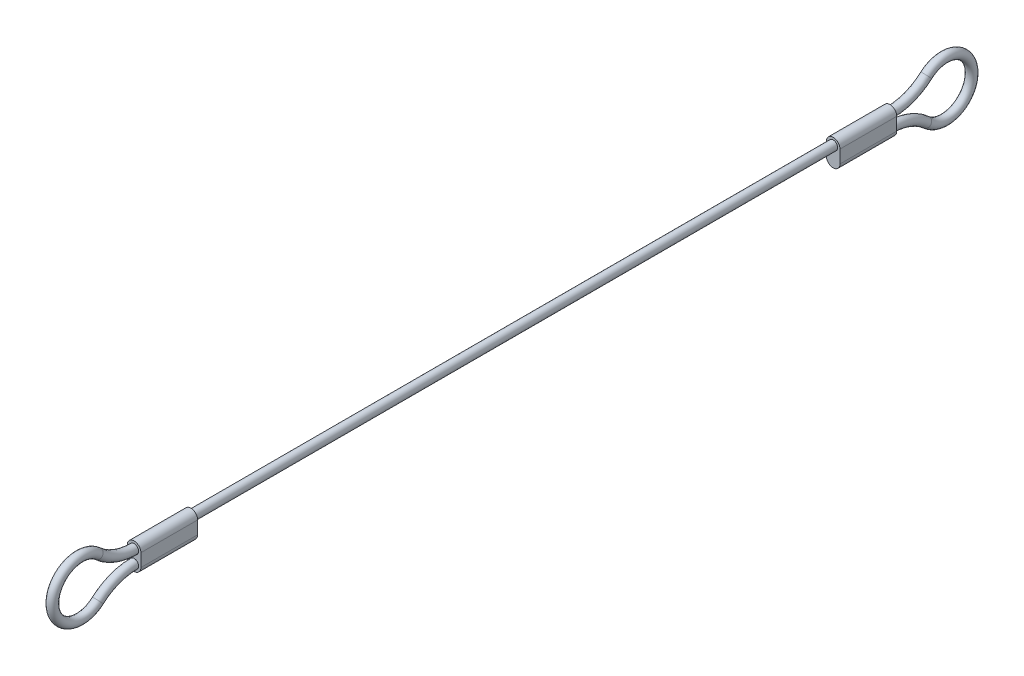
ISO-10303-21;
HEADER;
FILE_DESCRIPTION(('STEP AP214'),'2;1');
FILE_NAME('part.step','',(''),(''),'','','');
FILE_SCHEMA(('AUTOMOTIVE_DESIGN { 1 0 10303 214 1 1 1 1 }'));
ENDSEC;
DATA;
#1=APPLICATION_CONTEXT('core data for automotive mechanical design processes');
#2=APPLICATION_PROTOCOL_DEFINITION('international standard','automotive_design',2000,#1);
#3=PRODUCT_CONTEXT('',#1,'mechanical');
#4=PRODUCT('Part','Part','',(#3));
#5=PRODUCT_RELATED_PRODUCT_CATEGORY('part','',(#4));
#6=PRODUCT_DEFINITION_FORMATION('','',#4);
#7=PRODUCT_DEFINITION_CONTEXT('part definition',#1,'design');
#8=PRODUCT_DEFINITION('design','',#6,#7);
#9=PRODUCT_DEFINITION_SHAPE('','',#8);
#10=(LENGTH_UNIT() NAMED_UNIT(*) SI_UNIT(.MILLI.,.METRE.));
#11=(NAMED_UNIT(*) PLANE_ANGLE_UNIT() SI_UNIT($,.RADIAN.));
#12=(NAMED_UNIT(*) SI_UNIT($,.STERADIAN.) SOLID_ANGLE_UNIT());
#13=UNCERTAINTY_MEASURE_WITH_UNIT(LENGTH_MEASURE(1.E-05),#10,'distance_accuracy_value','');
#14=(GEOMETRIC_REPRESENTATION_CONTEXT(3) GLOBAL_UNCERTAINTY_ASSIGNED_CONTEXT((#13)) GLOBAL_UNIT_ASSIGNED_CONTEXT((#10,
#11,#12)) REPRESENTATION_CONTEXT('',''));
#15=CARTESIAN_POINT('',(0.,0.,0.));
#16=DIRECTION('',(0.,0.,1.));
#17=DIRECTION('',(1.,0.,0.));
#18=AXIS2_PLACEMENT_3D('',#15,#16,#17);
#19=CARTESIAN_POINT('',(0.,0.,-66.6));
#20=DIRECTION('',(0.,0.,1.));
#21=DIRECTION('',(1.,0.,0.));
#22=AXIS2_PLACEMENT_3D('',#19,#20,#21);
#23=CYLINDRICAL_SURFACE('',#22,0.795);
#24=CARTESIAN_POINT('',(0.,0.,-56.6));
#25=DIRECTION('',(0.,0.,1.));
#26=DIRECTION('',(0.,-1.,0.));
#27=AXIS2_PLACEMENT_3D('',#24,#25,#26);
#28=CIRCLE('',#27,0.795);
#29=CARTESIAN_POINT('',(0.,-0.795,-56.6));
#30=VERTEX_POINT('',#29);
#31=EDGE_CURVE('E11',#30,#30,#28,.F.);
#32=ORIENTED_EDGE('',*,*,#31,.F.);
#33=EDGE_LOOP('',(#32));
#34=FACE_BOUND('',#33,.T.);
#35=CARTESIAN_POINT('',(0.,0.,56.6));
#36=DIRECTION('',(0.,0.,-1.));
#37=DIRECTION('',(0.,1.,0.));
#38=AXIS2_PLACEMENT_3D('',#35,#36,#37);
#39=CIRCLE('',#38,0.795);
#40=CARTESIAN_POINT('',(0.,0.795,56.6));
#41=VERTEX_POINT('',#40);
#42=EDGE_CURVE('E48',#41,#41,#39,.F.);
#43=ORIENTED_EDGE('',*,*,#42,.F.);
#44=EDGE_LOOP('',(#43));
#45=FACE_BOUND('',#44,.T.);
#46=ADVANCED_FACE('F38',(#34,#45),#23,.T.);
#47=CARTESIAN_POINT('',(0.,0.,66.6));
#48=DIRECTION('',(0.,0.,-1.));
#49=DIRECTION('',(0.,1.,0.));
#50=AXIS2_PLACEMENT_3D('',#47,#48,#49);
#51=PLANE('',#50);
#52=CARTESIAN_POINT('',(0.,0.,66.6));
#53=DIRECTION('',(0.,0.,-1.));
#54=DIRECTION('',(0.,1.,0.));
#55=AXIS2_PLACEMENT_3D('',#52,#53,#54);
#56=CIRCLE('',#55,1.2);
#57=CARTESIAN_POINT('',(-1.2,0.,66.6));
#58=VERTEX_POINT('',#57);
#59=CARTESIAN_POINT('',(1.2,0.,66.6));
#60=VERTEX_POINT('',#59);
#61=EDGE_CURVE('E183',#58,#60,#56,.T.);
#62=ORIENTED_EDGE('',*,*,#61,.F.);
#63=DIRECTION('',(0.,1.,0.));
#64=VECTOR('',#63,1.);
#65=CARTESIAN_POINT('',(-1.2,0.,66.6));
#66=LINE('',#65,#64);
#67=CARTESIAN_POINT('',(-1.2,-2.26625258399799,66.6));
#68=VERTEX_POINT('',#67);
#69=EDGE_CURVE('E80',#68,#58,#66,.T.);
#70=ORIENTED_EDGE('',*,*,#69,.F.);
#71=CARTESIAN_POINT('',(0.,-2.26625258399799,66.6));
#72=DIRECTION('',(0.,0.,-1.));
#73=DIRECTION('',(0.,1.,0.));
#74=AXIS2_PLACEMENT_3D('',#71,#72,#73);
#75=CIRCLE('',#74,1.2);
#76=CARTESIAN_POINT('',(1.2,-2.26625258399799,66.6));
#77=VERTEX_POINT('',#76);
#78=EDGE_CURVE('E74',#77,#68,#75,.T.);
#79=ORIENTED_EDGE('',*,*,#78,.F.);
#80=DIRECTION('',(0.,-1.,0.));
#81=VECTOR('',#80,1.);
#82=CARTESIAN_POINT('',(1.2,0.,66.6));
#83=LINE('',#82,#81);
#84=EDGE_CURVE('E187',#60,#77,#83,.T.);
#85=ORIENTED_EDGE('',*,*,#84,.F.);
#86=EDGE_LOOP('',(#62,#70,#79,#85));
#87=FACE_BOUND('',#86,.T.);
#88=CARTESIAN_POINT('',(0.,0.,66.6));
#89=DIRECTION('',(0.,0.,-1.));
#90=DIRECTION('',(0.,1.,0.));
#91=AXIS2_PLACEMENT_3D('',#88,#89,#90);
#92=CIRCLE('',#91,0.795);
#93=CARTESIAN_POINT('',(0.,-0.795000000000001,66.6));
#94=VERTEX_POINT('',#93);
#95=EDGE_CURVE('E205',#94,#94,#92,.F.);
#96=ORIENTED_EDGE('',*,*,#95,.F.);
#97=EDGE_LOOP('',(#96));
#98=FACE_BOUND('',#97,.T.);
#99=CARTESIAN_POINT('',(0.,-2.26625258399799,66.6));
#100=DIRECTION('',(0.,0.,-1.));
#101=DIRECTION('',(1.,0.,0.));
#102=AXIS2_PLACEMENT_3D('',#99,#100,#101);
#103=CIRCLE('',#102,0.795);
#104=CARTESIAN_POINT('',(0.,-1.47125258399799,66.6));
#105=VERTEX_POINT('',#104);
#106=EDGE_CURVE('E230',#105,#105,#103,.T.);
#107=ORIENTED_EDGE('',*,*,#106,.T.);
#108=EDGE_LOOP('',(#107));
#109=FACE_BOUND('',#108,.T.);
#110=ADVANCED_FACE('F240',(#87,#98,#109),#51,.F.);
#111=CARTESIAN_POINT('',(0.,0.,56.6));
#112=DIRECTION('',(0.,0.,1.));
#113=DIRECTION('',(0.,-1.,0.));
#114=AXIS2_PLACEMENT_3D('',#111,#112,#113);
#115=CYLINDRICAL_SURFACE('',#114,1.2);
#116=ORIENTED_EDGE('',*,*,#61,.T.);
#117=DIRECTION('',(0.,0.,1.));
#118=VECTOR('',#117,1.);
#119=CARTESIAN_POINT('',(1.2,0.,56.6));
#120=LINE('',#119,#118);
#121=CARTESIAN_POINT('',(1.2,0.,56.6));
#122=VERTEX_POINT('',#121);
#123=EDGE_CURVE('E202',#122,#60,#120,.T.);
#124=ORIENTED_EDGE('',*,*,#123,.F.);
#125=CARTESIAN_POINT('',(0.,0.,56.6));
#126=DIRECTION('',(0.,0.,-1.));
#127=DIRECTION('',(0.,1.,0.));
#128=AXIS2_PLACEMENT_3D('',#125,#126,#127);
#129=CIRCLE('',#128,1.2);
#130=CARTESIAN_POINT('',(-1.2,0.,56.6));
#131=VERTEX_POINT('',#130);
#132=EDGE_CURVE('E172',#131,#122,#129,.T.);
#133=ORIENTED_EDGE('',*,*,#132,.F.);
#134=DIRECTION('',(0.,0.,1.));
#135=VECTOR('',#134,1.);
#136=CARTESIAN_POINT('',(-1.2,0.,56.6));
#137=LINE('',#136,#135);
#138=EDGE_CURVE('E182',#131,#58,#137,.T.);
#139=ORIENTED_EDGE('',*,*,#138,.T.);
#140=EDGE_LOOP('',(#116,#124,#133,#139));
#141=FACE_BOUND('',#140,.T.);
#142=ADVANCED_FACE('F246',(#141),#115,.T.);
#143=CARTESIAN_POINT('',(1.2,0.,56.6));
#144=DIRECTION('',(-1.,0.,0.));
#145=DIRECTION('',(0.,-1.,0.));
#146=AXIS2_PLACEMENT_3D('',#143,#144,#145);
#147=PLANE('',#146);
#148=ORIENTED_EDGE('',*,*,#84,.T.);
#149=DIRECTION('',(0.,0.,1.));
#150=VECTOR('',#149,1.);
#151=CARTESIAN_POINT('',(1.2,-2.266252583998,56.6));
#152=LINE('',#151,#150);
#153=CARTESIAN_POINT('',(1.2,-2.266252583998,56.6));
#154=VERTEX_POINT('',#153);
#155=EDGE_CURVE('E199',#154,#77,#152,.T.);
#156=ORIENTED_EDGE('',*,*,#155,.F.);
#157=DIRECTION('',(0.,-1.,0.));
#158=VECTOR('',#157,1.);
#159=CARTESIAN_POINT('',(1.2,0.,56.6));
#160=LINE('',#159,#158);
#161=EDGE_CURVE('E88',#122,#154,#160,.T.);
#162=ORIENTED_EDGE('',*,*,#161,.F.);
#163=ORIENTED_EDGE('',*,*,#123,.T.);
#164=EDGE_LOOP('',(#148,#156,#162,#163));
#165=FACE_BOUND('',#164,.T.);
#166=ADVANCED_FACE('F288',(#165),#147,.F.);
#167=CARTESIAN_POINT('',(0.,-2.266252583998,56.6));
#168=DIRECTION('',(0.,0.,1.));
#169=DIRECTION('',(0.,-1.,0.));
#170=AXIS2_PLACEMENT_3D('',#167,#168,#169);
#171=CYLINDRICAL_SURFACE('',#170,1.2);
#172=ORIENTED_EDGE('',*,*,#78,.T.);
#173=DIRECTION('',(0.,0.,1.));
#174=VECTOR('',#173,1.);
#175=CARTESIAN_POINT('',(-1.2,-2.266252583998,56.6));
#176=LINE('',#175,#174);
#177=CARTESIAN_POINT('',(-1.2,-2.266252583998,56.6));
#178=VERTEX_POINT('',#177);
#179=EDGE_CURVE('E196',#178,#68,#176,.T.);
#180=ORIENTED_EDGE('',*,*,#179,.F.);
#181=CARTESIAN_POINT('',(0.,-2.266252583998,56.6));
#182=DIRECTION('',(0.,0.,-1.));
#183=DIRECTION('',(0.,1.,0.));
#184=AXIS2_PLACEMENT_3D('',#181,#182,#183);
#185=CIRCLE('',#184,1.2);
#186=EDGE_CURVE('E177',#154,#178,#185,.T.);
#187=ORIENTED_EDGE('',*,*,#186,.F.);
#188=ORIENTED_EDGE('',*,*,#155,.T.);
#189=EDGE_LOOP('',(#172,#180,#187,#188));
#190=FACE_BOUND('',#189,.T.);
#191=ADVANCED_FACE('F281',(#190),#171,.T.);
#192=CARTESIAN_POINT('',(-1.2,0.,56.6));
#193=DIRECTION('',(1.,0.,0.));
#194=DIRECTION('',(0.,1.,0.));
#195=AXIS2_PLACEMENT_3D('',#192,#193,#194);
#196=PLANE('',#195);
#197=ORIENTED_EDGE('',*,*,#69,.T.);
#198=ORIENTED_EDGE('',*,*,#138,.F.);
#199=DIRECTION('',(0.,1.,0.));
#200=VECTOR('',#199,1.);
#201=CARTESIAN_POINT('',(-1.2,0.,56.6));
#202=LINE('',#201,#200);
#203=EDGE_CURVE('E56',#178,#131,#202,.T.);
#204=ORIENTED_EDGE('',*,*,#203,.F.);
#205=ORIENTED_EDGE('',*,*,#179,.T.);
#206=EDGE_LOOP('',(#197,#198,#204,#205));
#207=FACE_BOUND('',#206,.T.);
#208=ADVANCED_FACE('F276',(#207),#196,.F.);
#209=CARTESIAN_POINT('',(0.,0.,56.6));
#210=DIRECTION('',(0.,0.,-1.));
#211=DIRECTION('',(0.,1.,0.));
#212=AXIS2_PLACEMENT_3D('',#209,#210,#211);
#213=PLANE('',#212);
#214=ORIENTED_EDGE('',*,*,#42,.T.);
#215=EDGE_LOOP('',(#214));
#216=FACE_BOUND('',#215,.T.);
#217=ORIENTED_EDGE('',*,*,#132,.T.);
#218=ORIENTED_EDGE('',*,*,#161,.T.);
#219=ORIENTED_EDGE('',*,*,#186,.T.);
#220=ORIENTED_EDGE('',*,*,#203,.T.);
#221=EDGE_LOOP('',(#217,#218,#219,#220));
#222=FACE_BOUND('',#221,.T.);
#223=ADVANCED_FACE('F237',(#216,#222),#213,.T.);
#224=CARTESIAN_POINT('',(0.,-11.866252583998,66.6));
#225=DIRECTION('',(-1.,0.,0.));
#226=DIRECTION('',(0.,0.,1.));
#227=AXIS2_PLACEMENT_3D('',#224,#225,#226);
#228=TOROIDAL_SURFACE('',#227,9.59999999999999,0.795);
#229=CARTESIAN_POINT('',(0.,-4.71083505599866,73.));
#230=DIRECTION('',(0.,0.666666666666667,-0.74535599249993));
#231=DIRECTION('',(1.,0.,0.));
#232=AXIS2_PLACEMENT_3D('',#229,#230,#231);
#233=CIRCLE('',#232,0.795);
#234=CARTESIAN_POINT('',(0.,-4.11827704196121,73.53));
#235=VERTEX_POINT('',#234);
#236=EDGE_CURVE('E227',#235,#235,#233,.T.);
#237=CARTESIAN_POINT('',(0.,-11.866252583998,66.6));
#238=DIRECTION('',(-1.,0.,0.));
#239=DIRECTION('',(0.,0.,1.));
#240=AXIS2_PLACEMENT_3D('',#237,#238,#239);
#241=CIRCLE('',#240,10.395);
#242=EDGE_CURVE('',#235,#105,#241,.T.);
#243=ORIENTED_EDGE('',*,*,#236,.T.);
#244=ORIENTED_EDGE('',*,*,#106,.F.);
#245=ORIENTED_EDGE('',*,*,#242,.T.);
#246=ORIENTED_EDGE('',*,*,#242,.F.);
#247=EDGE_LOOP('',(#243,#245,#244,#246));
#248=FACE_BOUND('',#247,.T.);
#249=ADVANCED_FACE('F40',(#248),#228,.T.);
#250=CARTESIAN_POINT('',(0.,-1.13312629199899,76.2));
#251=DIRECTION('',(1.,0.,0.));
#252=DIRECTION('',(0.,0.,-1.));
#253=AXIS2_PLACEMENT_3D('',#250,#251,#252);
#254=TOROIDAL_SURFACE('',#253,4.8,0.795);
#255=ORIENTED_EDGE('',*,*,#236,.F.);
#256=EDGE_LOOP('',(#255));
#257=FACE_BOUND('',#256,.T.);
#258=CARTESIAN_POINT('',(0.,2.44458247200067,73.));
#259=DIRECTION('',(0.,0.666666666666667,0.74535599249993));
#260=DIRECTION('',(1.,0.,0.));
#261=AXIS2_PLACEMENT_3D('',#258,#259,#260);
#262=CIRCLE('',#261,0.795);
#263=CARTESIAN_POINT('',(0.,1.85202445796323,73.53));
#264=VERTEX_POINT('',#263);
#265=EDGE_CURVE('E224',#264,#264,#262,.T.);
#266=ORIENTED_EDGE('',*,*,#265,.T.);
#267=EDGE_LOOP('',(#266));
#268=FACE_BOUND('',#267,.T.);
#269=ADVANCED_FACE('F256',(#257,#268),#254,.T.);
#270=CARTESIAN_POINT('',(0.,9.59999999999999,66.6));
#271=DIRECTION('',(-1.,0.,0.));
#272=DIRECTION('',(0.,0.,1.));
#273=AXIS2_PLACEMENT_3D('',#270,#271,#272);
#274=TOROIDAL_SURFACE('',#273,9.59999999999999,0.795);
#275=CARTESIAN_POINT('',(0.,9.59999999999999,66.6));
#276=DIRECTION('',(-1.,0.,0.));
#277=DIRECTION('',(0.,0.,1.));
#278=AXIS2_PLACEMENT_3D('',#275,#276,#277);
#279=CIRCLE('',#278,10.395);
#280=EDGE_CURVE('',#94,#264,#279,.T.);
#281=ORIENTED_EDGE('',*,*,#95,.T.);
#282=ORIENTED_EDGE('',*,*,#265,.F.);
#283=ORIENTED_EDGE('',*,*,#280,.T.);
#284=ORIENTED_EDGE('',*,*,#280,.F.);
#285=EDGE_LOOP('',(#281,#283,#282,#284));
#286=FACE_BOUND('',#285,.T.);
#287=ADVANCED_FACE('F254',(#286),#274,.T.);
#288=CARTESIAN_POINT('',(0.,0.,-56.6));
#289=DIRECTION('',(0.,0.,-1.));
#290=DIRECTION('',(0.,1.,0.));
#291=AXIS2_PLACEMENT_3D('',#288,#289,#290);
#292=CYLINDRICAL_SURFACE('',#291,1.2);
#293=CARTESIAN_POINT('',(0.,0.,-66.6));
#294=DIRECTION('',(0.,0.,-1.));
#295=DIRECTION('',(0.,1.,0.));
#296=AXIS2_PLACEMENT_3D('',#293,#294,#295);
#297=CIRCLE('',#296,1.2);
#298=CARTESIAN_POINT('',(-1.2,0.,-66.6));
#299=VERTEX_POINT('',#298);
#300=CARTESIAN_POINT('',(1.2,0.,-66.6));
#301=VERTEX_POINT('',#300);
#302=EDGE_CURVE('E121',#299,#301,#297,.T.);
#303=ORIENTED_EDGE('',*,*,#302,.F.);
#304=DIRECTION('',(0.,0.,-1.));
#305=VECTOR('',#304,1.);
#306=CARTESIAN_POINT('',(-1.2,0.,-56.6));
#307=LINE('',#306,#305);
#308=CARTESIAN_POINT('',(-1.2,0.,-56.6));
#309=VERTEX_POINT('',#308);
#310=EDGE_CURVE('E115',#309,#299,#307,.T.);
#311=ORIENTED_EDGE('',*,*,#310,.F.);
#312=CARTESIAN_POINT('',(0.,0.,-56.6));
#313=DIRECTION('',(0.,0.,-1.));
#314=DIRECTION('',(0.,1.,0.));
#315=AXIS2_PLACEMENT_3D('',#312,#313,#314);
#316=CIRCLE('',#315,1.2);
#317=CARTESIAN_POINT('',(1.2,0.,-56.6));
#318=VERTEX_POINT('',#317);
#319=EDGE_CURVE('E118',#309,#318,#316,.T.);
#320=ORIENTED_EDGE('',*,*,#319,.T.);
#321=DIRECTION('',(0.,0.,-1.));
#322=VECTOR('',#321,1.);
#323=CARTESIAN_POINT('',(1.2,0.,-56.6));
#324=LINE('',#323,#322);
#325=EDGE_CURVE('E152',#318,#301,#324,.T.);
#326=ORIENTED_EDGE('',*,*,#325,.T.);
#327=EDGE_LOOP('',(#303,#311,#320,#326));
#328=FACE_BOUND('',#327,.T.);
#329=ADVANCED_FACE('F117',(#328),#292,.T.);
#330=CARTESIAN_POINT('',(-1.2,0.,-56.6));
#331=DIRECTION('',(-1.,0.,0.));
#332=DIRECTION('',(0.,-1.,0.));
#333=AXIS2_PLACEMENT_3D('',#330,#331,#332);
#334=PLANE('',#333);
#335=DIRECTION('',(0.,1.,0.));
#336=VECTOR('',#335,1.);
#337=CARTESIAN_POINT('',(-1.2,0.,-66.6));
#338=LINE('',#337,#336);
#339=CARTESIAN_POINT('',(-1.2,-2.26625258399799,-66.6));
#340=VERTEX_POINT('',#339);
#341=EDGE_CURVE('E155',#340,#299,#338,.T.);
#342=ORIENTED_EDGE('',*,*,#341,.F.);
#343=DIRECTION('',(0.,0.,-1.));
#344=VECTOR('',#343,1.);
#345=CARTESIAN_POINT('',(-1.2,-2.266252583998,-56.6));
#346=LINE('',#345,#344);
#347=CARTESIAN_POINT('',(-1.2,-2.266252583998,-56.6));
#348=VERTEX_POINT('',#347);
#349=EDGE_CURVE('E128',#348,#340,#346,.T.);
#350=ORIENTED_EDGE('',*,*,#349,.F.);
#351=DIRECTION('',(0.,1.,0.));
#352=VECTOR('',#351,1.);
#353=CARTESIAN_POINT('',(-1.2,0.,-56.6));
#354=LINE('',#353,#352);
#355=EDGE_CURVE('E134',#348,#309,#354,.T.);
#356=ORIENTED_EDGE('',*,*,#355,.T.);
#357=ORIENTED_EDGE('',*,*,#310,.T.);
#358=EDGE_LOOP('',(#342,#350,#356,#357));
#359=FACE_BOUND('',#358,.T.);
#360=ADVANCED_FACE('F141',(#359),#334,.T.);
#361=CARTESIAN_POINT('',(0.,-2.266252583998,-56.6));
#362=DIRECTION('',(0.,0.,-1.));
#363=DIRECTION('',(0.,1.,0.));
#364=AXIS2_PLACEMENT_3D('',#361,#362,#363);
#365=CYLINDRICAL_SURFACE('',#364,1.2);
#366=CARTESIAN_POINT('',(0.,-2.26625258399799,-66.6));
#367=DIRECTION('',(0.,0.,-1.));
#368=DIRECTION('',(0.,1.,0.));
#369=AXIS2_PLACEMENT_3D('',#366,#367,#368);
#370=CIRCLE('',#369,1.2);
#371=CARTESIAN_POINT('',(1.2,-2.26625258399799,-66.6));
#372=VERTEX_POINT('',#371);
#373=EDGE_CURVE('E158',#372,#340,#370,.T.);
#374=ORIENTED_EDGE('',*,*,#373,.F.);
#375=DIRECTION('',(0.,0.,-1.));
#376=VECTOR('',#375,1.);
#377=CARTESIAN_POINT('',(1.2,-2.266252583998,-56.6));
#378=LINE('',#377,#376);
#379=CARTESIAN_POINT('',(1.2,-2.266252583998,-56.6));
#380=VERTEX_POINT('',#379);
#381=EDGE_CURVE('E167',#380,#372,#378,.T.);
#382=ORIENTED_EDGE('',*,*,#381,.F.);
#383=CARTESIAN_POINT('',(0.,-2.266252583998,-56.6));
#384=DIRECTION('',(0.,0.,-1.));
#385=DIRECTION('',(0.,1.,0.));
#386=AXIS2_PLACEMENT_3D('',#383,#384,#385);
#387=CIRCLE('',#386,1.2);
#388=EDGE_CURVE('E143',#380,#348,#387,.T.);
#389=ORIENTED_EDGE('',*,*,#388,.T.);
#390=ORIENTED_EDGE('',*,*,#349,.T.);
#391=EDGE_LOOP('',(#374,#382,#389,#390));
#392=FACE_BOUND('',#391,.T.);
#393=ADVANCED_FACE('F321',(#392),#365,.T.);
#394=CARTESIAN_POINT('',(1.2,0.,-56.6));
#395=DIRECTION('',(1.,0.,0.));
#396=DIRECTION('',(0.,1.,0.));
#397=AXIS2_PLACEMENT_3D('',#394,#395,#396);
#398=PLANE('',#397);
#399=DIRECTION('',(0.,-1.,0.));
#400=VECTOR('',#399,1.);
#401=CARTESIAN_POINT('',(1.2,0.,-66.6));
#402=LINE('',#401,#400);
#403=EDGE_CURVE('E139',#301,#372,#402,.T.);
#404=ORIENTED_EDGE('',*,*,#403,.F.);
#405=ORIENTED_EDGE('',*,*,#325,.F.);
#406=DIRECTION('',(0.,-1.,0.));
#407=VECTOR('',#406,1.);
#408=CARTESIAN_POINT('',(1.2,0.,-56.6));
#409=LINE('',#408,#407);
#410=EDGE_CURVE('E137',#318,#380,#409,.T.);
#411=ORIENTED_EDGE('',*,*,#410,.T.);
#412=ORIENTED_EDGE('',*,*,#381,.T.);
#413=EDGE_LOOP('',(#404,#405,#411,#412));
#414=FACE_BOUND('',#413,.T.);
#415=ADVANCED_FACE('F318',(#414),#398,.T.);
#416=CARTESIAN_POINT('',(0.,0.,-56.6));
#417=DIRECTION('',(0.,0.,1.));
#418=DIRECTION('',(0.,1.,0.));
#419=AXIS2_PLACEMENT_3D('',#416,#417,#418);
#420=PLANE('',#419);
#421=ORIENTED_EDGE('',*,*,#31,.T.);
#422=EDGE_LOOP('',(#421));
#423=FACE_BOUND('',#422,.T.);
#424=ORIENTED_EDGE('',*,*,#319,.F.);
#425=ORIENTED_EDGE('',*,*,#355,.F.);
#426=ORIENTED_EDGE('',*,*,#388,.F.);
#427=ORIENTED_EDGE('',*,*,#410,.F.);
#428=EDGE_LOOP('',(#424,#425,#426,#427));
#429=FACE_BOUND('',#428,.T.);
#430=ADVANCED_FACE('F132',(#423,#429),#420,.T.);
#431=CARTESIAN_POINT('',(0.,0.,-66.6));
#432=DIRECTION('',(0.,0.,1.));
#433=DIRECTION('',(0.,1.,0.));
#434=AXIS2_PLACEMENT_3D('',#431,#432,#433);
#435=PLANE('',#434);
#436=CARTESIAN_POINT('',(0.,-2.26625258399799,-66.6));
#437=DIRECTION('',(0.,0.,-1.));
#438=DIRECTION('',(1.,0.,0.));
#439=AXIS2_PLACEMENT_3D('',#436,#437,#438);
#440=CIRCLE('',#439,0.795);
#441=CARTESIAN_POINT('',(0.,-1.47125258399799,-66.6));
#442=VERTEX_POINT('',#441);
#443=EDGE_CURVE('E127',#442,#442,#440,.T.);
#444=ORIENTED_EDGE('',*,*,#443,.F.);
#445=EDGE_LOOP('',(#444));
#446=FACE_BOUND('',#445,.T.);
#447=CARTESIAN_POINT('',(0.,0.,-66.6));
#448=DIRECTION('',(0.,0.,1.));
#449=DIRECTION('',(1.,0.,0.));
#450=AXIS2_PLACEMENT_3D('',#447,#448,#449);
#451=CIRCLE('',#450,0.795);
#452=CARTESIAN_POINT('',(0.,-0.795000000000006,-66.6));
#453=VERTEX_POINT('',#452);
#454=EDGE_CURVE('E220',#453,#453,#451,.T.);
#455=ORIENTED_EDGE('',*,*,#454,.T.);
#456=EDGE_LOOP('',(#455));
#457=FACE_BOUND('',#456,.T.);
#458=ORIENTED_EDGE('',*,*,#302,.T.);
#459=ORIENTED_EDGE('',*,*,#403,.T.);
#460=ORIENTED_EDGE('',*,*,#373,.T.);
#461=ORIENTED_EDGE('',*,*,#341,.T.);
#462=EDGE_LOOP('',(#458,#459,#460,#461));
#463=FACE_BOUND('',#462,.T.);
#464=ADVANCED_FACE('F297',(#446,#457,#463),#435,.F.);
#465=CARTESIAN_POINT('',(0.,-11.866252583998,-66.6));
#466=DIRECTION('',(-1.,0.,0.));
#467=DIRECTION('',(0.,0.,1.));
#468=AXIS2_PLACEMENT_3D('',#465,#466,#467);
#469=TOROIDAL_SURFACE('',#468,9.59999999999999,0.795);
#470=CARTESIAN_POINT('',(0.,-4.71083505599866,-73.));
#471=DIRECTION('',(0.,-0.666666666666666,-0.745355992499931));
#472=DIRECTION('',(1.,0.,0.));
#473=AXIS2_PLACEMENT_3D('',#470,#471,#472);
#474=CIRCLE('',#473,0.795);
#475=CARTESIAN_POINT('',(0.,-4.11827704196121,-73.53));
#476=VERTEX_POINT('',#475);
#477=EDGE_CURVE('E209',#476,#476,#474,.T.);
#478=CARTESIAN_POINT('',(0.,-11.866252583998,-66.6));
#479=DIRECTION('',(-1.,0.,0.));
#480=DIRECTION('',(0.,0.,1.));
#481=AXIS2_PLACEMENT_3D('',#478,#479,#480);
#482=CIRCLE('',#481,10.395);
#483=EDGE_CURVE('',#442,#476,#482,.T.);
#484=ORIENTED_EDGE('',*,*,#443,.T.);
#485=ORIENTED_EDGE('',*,*,#477,.F.);
#486=ORIENTED_EDGE('',*,*,#483,.T.);
#487=ORIENTED_EDGE('',*,*,#483,.F.);
#488=EDGE_LOOP('',(#484,#486,#485,#487));
#489=FACE_BOUND('',#488,.T.);
#490=ADVANCED_FACE('F294',(#489),#469,.T.);
#491=CARTESIAN_POINT('',(0.,-1.13312629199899,-76.2));
#492=DIRECTION('',(1.,0.,0.));
#493=DIRECTION('',(0.,0.,-1.));
#494=AXIS2_PLACEMENT_3D('',#491,#492,#493);
#495=TOROIDAL_SURFACE('',#494,4.8,0.795);
#496=CARTESIAN_POINT('',(0.,2.44458247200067,-73.));
#497=DIRECTION('',(0.,-0.666666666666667,0.74535599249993));
#498=DIRECTION('',(1.,0.,0.));
#499=AXIS2_PLACEMENT_3D('',#496,#497,#498);
#500=CIRCLE('',#499,0.795);
#501=CARTESIAN_POINT('',(0.,1.85202445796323,-73.53));
#502=VERTEX_POINT('',#501);
#503=EDGE_CURVE('E216',#502,#502,#500,.T.);
#504=ORIENTED_EDGE('',*,*,#503,.F.);
#505=EDGE_LOOP('',(#504));
#506=FACE_BOUND('',#505,.T.);
#507=ORIENTED_EDGE('',*,*,#477,.T.);
#508=EDGE_LOOP('',(#507));
#509=FACE_BOUND('',#508,.T.);
#510=ADVANCED_FACE('F296',(#506,#509),#495,.T.);
#511=CARTESIAN_POINT('',(0.,9.59999999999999,-66.6));
#512=DIRECTION('',(-1.,0.,0.));
#513=DIRECTION('',(0.,0.,1.));
#514=AXIS2_PLACEMENT_3D('',#511,#512,#513);
#515=TOROIDAL_SURFACE('',#514,9.6,0.795);
#516=CARTESIAN_POINT('',(0.,9.59999999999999,-66.6));
#517=DIRECTION('',(-1.,0.,0.));
#518=DIRECTION('',(0.,0.,1.));
#519=AXIS2_PLACEMENT_3D('',#516,#517,#518);
#520=CIRCLE('',#519,10.395);
#521=EDGE_CURVE('',#502,#453,#520,.T.);
#522=ORIENTED_EDGE('',*,*,#503,.T.);
#523=ORIENTED_EDGE('',*,*,#454,.F.);
#524=ORIENTED_EDGE('',*,*,#521,.T.);
#525=ORIENTED_EDGE('',*,*,#521,.F.);
#526=EDGE_LOOP('',(#522,#524,#523,#525));
#527=FACE_BOUND('',#526,.T.);
#528=ADVANCED_FACE('F252',(#527),#515,.T.);
#529=CLOSED_SHELL('',(#46,#110,#142,#166,#191,#208,#223,#249,#269,#287,#329,#360,#393,#415,#430,
#464,#490,#510,#528));
#530=MANIFOLD_SOLID_BREP('B2',#529);
#531=ADVANCED_BREP_SHAPE_REPRESENTATION('',(#18,#530),#14);
#532=SHAPE_DEFINITION_REPRESENTATION(#9,#531);
ENDSEC;
END-ISO-10303-21;
